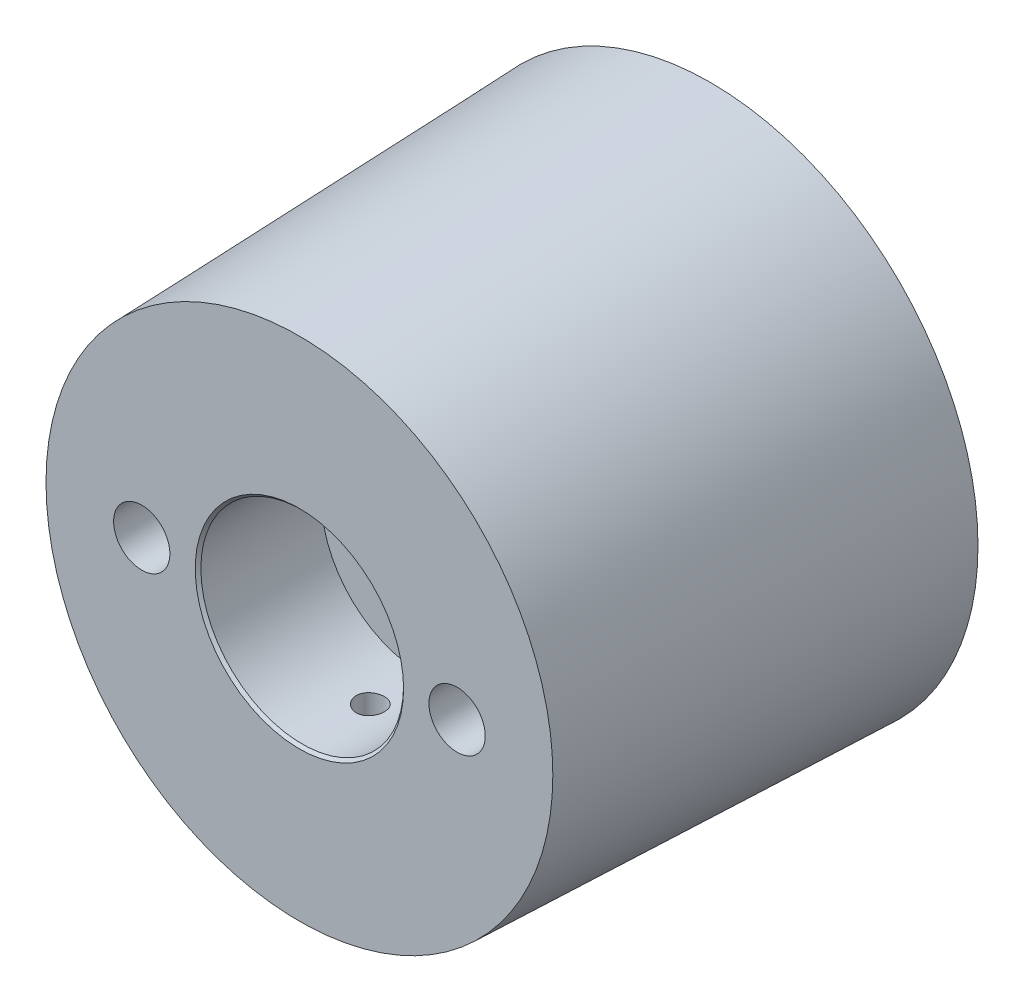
from build123d import *

# Parameters (mm, degrees)
SKETCH2_R                      = 45
SKETCH6_R                      = 47.5
SKETCH7_R                      = 35.05
CUT_EXTRUDE2_DEPTH             = 43.7
SKETCH8_R                      = 18
CUT_EXTRUDE3_DEPTH             = 21.9
CHAMFER1_SIZE                  = 0.5
CBORE_FOR_M5_SHCS1_D           = 5.3
CBORE_FOR_M5_SHCS1_CBORE_D     = 10
CBORE_FOR_M5_SHCS1_CBORE_DEPTH = 13
CUT_EXTRUDE4_REACH             = 99.018
SKETCH11_R                     = 2.5
CUT_EXTRUDE5_REACH             = 86.402
SKETCH12_R                     = 8
SKETCH13_R                     = 14
CUT_EXTRUDE6_DEPTH             = 4


with BuildPart() as part:
    # Sketch2 → Loft1 section 0
    with BuildSketch(Plane.XY.offset(70)):
        Circle(SKETCH2_R)
    # Sketch6 → Loft1 section 1
    with BuildSketch(Plane.XY.offset(-3)):
        Circle(SKETCH6_R)
    loft()

    # Sketch7 → Cut-Extrude2 (cut)
    with BuildSketch(Plane(origin=(0, 0, -3), x_dir=(-1, 0, 0), z_dir=(0, 0, -1))):
        Circle(SKETCH7_R)
    extrude(amount=-CUT_EXTRUDE2_DEPTH, mode=Mode.SUBTRACT)

    # Sketch8 → Cut-Extrude3 (cut)
    with BuildSketch(Plane.XY.offset(70)):
        Circle(SKETCH8_R)
    extrude(amount=-CUT_EXTRUDE3_DEPTH, mode=Mode.SUBTRACT)

    # Chamfer1
    chamfer1_edges = [part.edges().sort_by_distance(p)[0] for p in [
        (-18, 0, 70),
        (35.05, 0, -3),
    ]]
    chamfer(chamfer1_edges, length=CHAMFER1_SIZE)

    # CBORE for M5 SHCS1 (through all)
    with Locations(Plane.XY.offset(70)):
        with Locations((-28, 0), (28, 0)):
            CounterBoreHole(CBORE_FOR_M5_SHCS1_D / 2, CBORE_FOR_M5_SHCS1_CBORE_D / 2, CBORE_FOR_M5_SHCS1_CBORE_DEPTH)

    # Cut-Extrude4: up to this cone (the profile starts inside it)
    cut_extrude4_end = Plane(origin=(0, 0, 57.4), z_dir=(0, 0, -1)) * Cone(40.467482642, 50.395531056, 289.899013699, mode=Mode.PRIVATE)
    # Sketch11 → Cut-Extrude4 (cut, up to the surface)
    with BuildSketch(Plane(origin=(0, 0, 0), x_dir=(1, 0, 0), z_dir=(0, 1, 0)), mode=Mode.PRIVATE) as cut_extrude4_sk1:
        with Locations(Location((0, -57.4, 0), (0, 0, 270))):
            Circle(SKETCH11_R)
    cut_extrude4_tool1 = extrude(cut_extrude4_sk1.sketch, amount=-CUT_EXTRUDE4_REACH, mode=Mode.PRIVATE) & cut_extrude4_end
    add(cut_extrude4_tool1.solids().sort_by_distance((0, 0, 57.4))[0], mode=Mode.SUBTRACT)

    # Sketch12 → Cut-Extrude5 (cut, up to next)
    with BuildSketch(Plane.XY.offset(48.1), mode=Mode.PRIVATE) as cut_extrude5_sk1:
        Circle(SKETCH12_R)
    cut_extrude5_tool1 = extrude(cut_extrude5_sk1.sketch, amount=-CUT_EXTRUDE5_REACH, mode=Mode.PRIVATE) & part.part
    add(cut_extrude5_tool1.solids().sort_by_distance((0, 0, 48.1))[0], mode=Mode.SUBTRACT)

    # Sketch13 → Cut-Extrude6 (cut)
    with BuildSketch(Plane(origin=(0, 0, 40.7), x_dir=(-1, 0, 0), z_dir=(0, 0, -1))):
        Circle(SKETCH13_R)
    extrude(amount=-CUT_EXTRUDE6_DEPTH, mode=Mode.SUBTRACT)


solid = part.part
